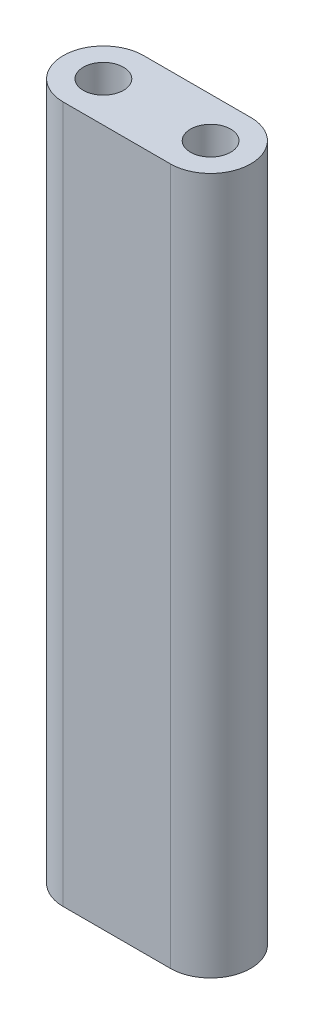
from build123d import *

# Parameters (mm, degrees)
SKETCH1_R           = 3
SKETCH1_R_2         = 1.5
BOSS_EXTRUDE1_DEPTH = 52


with BuildPart() as part:
    # Sketch1 → Boss-Extrude1 (new body)
    # profile 1 of 3: a face of its own
    with BuildSketch(Plane(origin=(0, 0, 0), x_dir=(1, 0, 0), z_dir=(0, 1, 0))):
        with Locations((-2.766370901, 0)):
            Circle(SKETCH1_R)
        with Locations(Location((-2.766370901, 0, 0), (0, 0, 90))):
            Circle(SKETCH1_R_2, mode=Mode.SUBTRACT)
    # profile 2 of 3: a face of its own
    with BuildSketch(Plane(origin=(0, 0, 0), x_dir=(1, 0, 0), z_dir=(0, 1, 0))):
        with BuildLine():
            Line((5.233629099, 3), (-2.766370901, 3))
            ThreePointArc((-2.766370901, 3), (-0.645050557, 2.121320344), (0.233629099, 0))
            ThreePointArc((0.233629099, 0), (-0.645050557, -2.121320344), (-2.766370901, -3))
            Line((-2.766370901, -3), (5.233629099, -3))
            ThreePointArc((5.233629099, -3), (2.233629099, 0), (5.233629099, 3))
        make_face()
    # profile 3 of 3: a face of its own
    with BuildSketch(Plane(origin=(0, 0, 0), x_dir=(1, 0, 0), z_dir=(0, 1, 0))):
        with Locations((5.233629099, 0)):
            Circle(SKETCH1_R)
        with Locations(Location((5.233629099, 0, 0), (0, 0, 90))):
            Circle(SKETCH1_R_2, mode=Mode.SUBTRACT)
    extrude(amount=BOSS_EXTRUDE1_DEPTH)


solid = part.part
